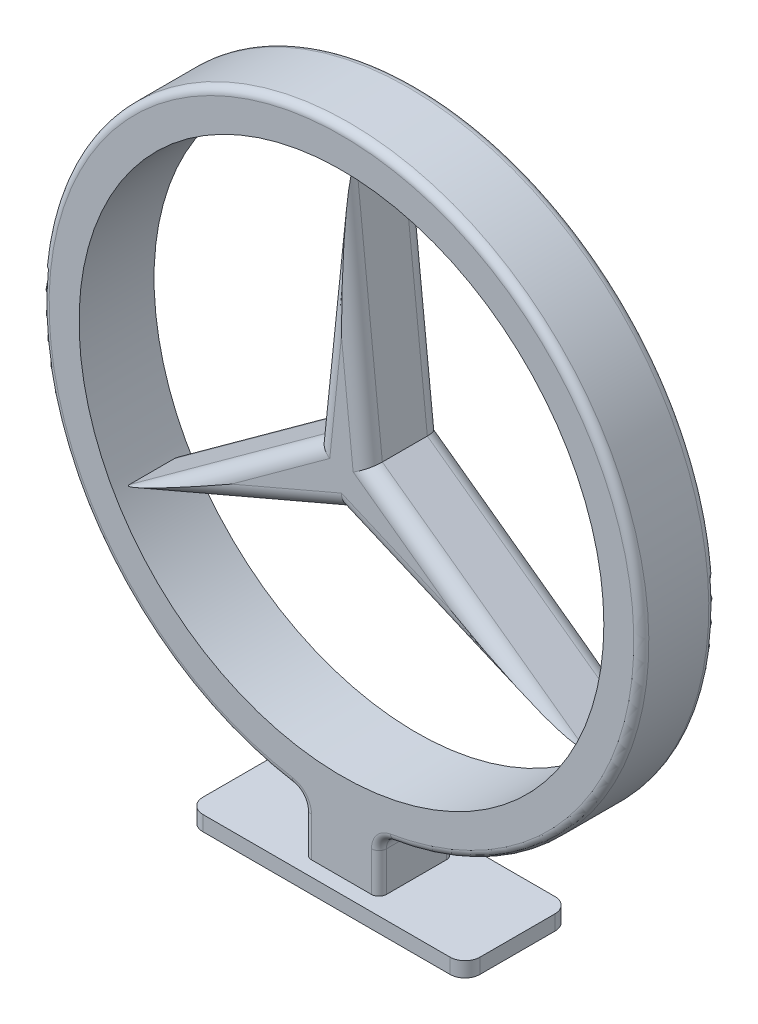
from build123d import *

# Parameters (mm, degrees)
SKIZZE1_R                       = 35
AUFSATZ_LINEAR_AUSTRAGEN1_DEPTH = 10
VERRUNDUNG2_R                   = 2
VERRUNDUNG3_R                   = 2
AUFSATZ_LINEAR_AUSTRAGEN2_DEPTH = 10
VERRUNDUNG4_R                   = 2
SKIZZE3_W                       = 10
SKIZZE3_H                       = 10
AUFSATZ_LINEAR_AUSTRAGEN3_DEPTH = 5
AUFSATZ_LINEAR_AUSTRAGEN4_DEPTH = 2
VERRUNDUNG5_R                   = 1


with BuildPart() as part:
    # Skizze1 → Aufsatz-Linear austragen1 (new body)
    with BuildSketch(Plane.XY):
        with BuildLine():
            Line((5, -41.686269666), (5, -39.686269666))
            ThreePointArc((5, -39.686269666), (0, 40), (-5, -39.686269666))
            Line((-5, -39.686269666), (-5, -41.686269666))
            Line((-5, -41.686269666), (5, -41.686269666))
        make_face()
        Circle(SKIZZE1_R, mode=Mode.SUBTRACT)
    extrude(amount=AUFSATZ_LINEAR_AUSTRAGEN1_DEPTH)

    # Verrundung2
    verrundung2_edges = [part.edges().sort_by_distance(p)[0] for p in [
        (5, -39.686269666, 5),
    ]]
    fillet(verrundung2_edges, radius=VERRUNDUNG2_R)

    # Verrundung3
    verrundung3_edges = [part.edges().sort_by_distance(p)[0] for p in [
        (-5, -39.686269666, 5),
    ]]
    fillet(verrundung3_edges, radius=VERRUNDUNG3_R)

    # Skizze3 → Aufsatz-Linear austragen3 (add)
    with BuildSketch(Plane(origin=(0, -41.686269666, 0), x_dir=(-1, 0, 0), z_dir=(0, -1, 0))):
        with Locations((0, -5)):
            Rectangle(SKIZZE3_W, SKIZZE3_H)
    extrude(amount=AUFSATZ_LINEAR_AUSTRAGEN3_DEPTH)

    # Skizze4 → Aufsatz-Linear austragen4 (add)
    with BuildSketch(Plane(origin=(0, -46.686269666, 0), x_dir=(-1, 0, 0), z_dir=(0, -1, 0))):
        with BuildLine():
            Line((16.478204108, -12), (-16.478204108, -12))
            ThreePointArc((-16.478204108, -12), (-17.89241767, -11.414213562), (-18.478204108, -10))
            Line((-18.478204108, -10), (-18.478204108, 0))
            ThreePointArc((-18.478204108, 0), (-17.89241767, 1.414213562), (-16.478204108, 2))
            Line((-16.478204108, 2), (16.478204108, 2))
            ThreePointArc((16.478204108, 2), (17.89241767, 1.414213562), (18.478204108, 0))
            Line((18.478204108, 0), (18.478204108, -10))
            ThreePointArc((18.478204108, -10), (17.89241767, -11.414213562), (16.478204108, -12))
        make_face()
    extrude(amount=AUFSATZ_LINEAR_AUSTRAGEN4_DEPTH)

    # Verrundung5
    verrundung5_edges = [part.edges().sort_by_distance(p)[0] for p in [
        (5, -44.049414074, 10),
        (0, 40, 0),
        (0, 40, 10),
        (5.472474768, -40.121564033, 10),
        (5.472474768, -40.121564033, 0),
        (-5, -44.049414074, 0),
        (-5, -44.049414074, 10),
        (-5.472474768, -40.121564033, 0),
        (-5.472474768, -40.121564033, 10),
        (5, -44.049414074, 0),
    ]]
    fillet(verrundung5_edges, radius=VERRUNDUNG5_R)


with BuildPart() as body_2:
    # Skizze2 → Aufsatz-Linear austragen2 (new body)
    with BuildSketch(Plane.XY.offset(10)):
        Polygon((-30.310889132, -17.5), (0, -4.5), (30.310889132, -17.5), (3.453139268, 1.993670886), (0, 35), (-3.453139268, 1.993670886), align=None)
    extrude(amount=-AUFSATZ_LINEAR_AUSTRAGEN2_DEPTH)

    # Verrundung4
    verrundung4_edges = [body_2.edges().sort_by_distance(p)[0] for p in [
        (15.155444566, -11, 0),
        (16.8820142, -7.753164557, 0),
        (1.726569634, 18.496835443, 0),
        (-1.726569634, 18.496835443, 0),
        (-16.8820142, -7.753164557, 0),
        (-15.155444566, -11, 0),
        (-1.726569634, 18.496835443, 10),
        (1.726569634, 18.496835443, 10),
        (16.8820142, -7.753164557, 10),
        (15.155444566, -11, 10),
        (-15.155444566, -11, 10),
        (-16.8820142, -7.753164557, 10),
    ]]
    fillet(verrundung4_edges, radius=VERRUNDUNG4_R)


solid = Compound([part.part, body_2.part])
